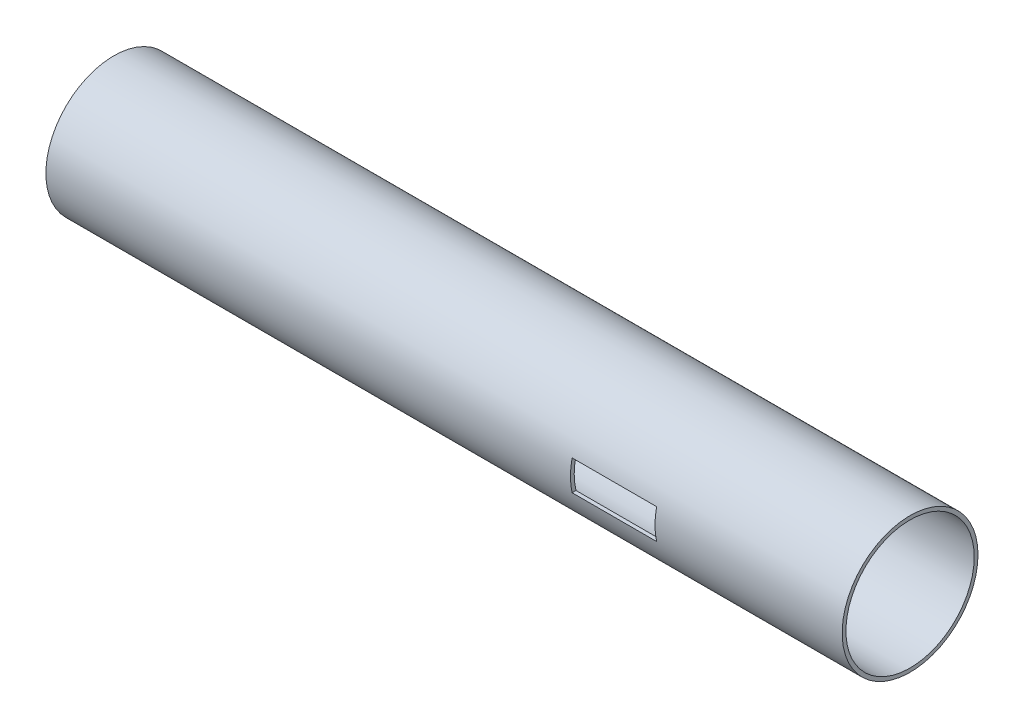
ISO-10303-21;
HEADER;
FILE_DESCRIPTION(('STEP AP214'),'2;1');
FILE_NAME('part.step','',(''),(''),'','','');
FILE_SCHEMA(('AUTOMOTIVE_DESIGN { 1 0 10303 214 1 1 1 1 }'));
ENDSEC;
DATA;
#1=APPLICATION_CONTEXT('core data for automotive mechanical design processes');
#2=APPLICATION_PROTOCOL_DEFINITION('international standard','automotive_design',2000,#1);
#3=PRODUCT_CONTEXT('',#1,'mechanical');
#4=PRODUCT('Part','Part','',(#3));
#5=PRODUCT_RELATED_PRODUCT_CATEGORY('part','',(#4));
#6=PRODUCT_DEFINITION_FORMATION('','',#4);
#7=PRODUCT_DEFINITION_CONTEXT('part definition',#1,'design');
#8=PRODUCT_DEFINITION('design','',#6,#7);
#9=PRODUCT_DEFINITION_SHAPE('','',#8);
#10=(LENGTH_UNIT() NAMED_UNIT(*) SI_UNIT(.MILLI.,.METRE.));
#11=(NAMED_UNIT(*) PLANE_ANGLE_UNIT() SI_UNIT($,.RADIAN.));
#12=(NAMED_UNIT(*) SI_UNIT($,.STERADIAN.) SOLID_ANGLE_UNIT());
#13=UNCERTAINTY_MEASURE_WITH_UNIT(LENGTH_MEASURE(1.E-05),#10,'distance_accuracy_value','');
#14=(GEOMETRIC_REPRESENTATION_CONTEXT(3) GLOBAL_UNCERTAINTY_ASSIGNED_CONTEXT((#13)) GLOBAL_UNIT_ASSIGNED_CONTEXT((#10,
#11,#12)) REPRESENTATION_CONTEXT('',''));
#15=CARTESIAN_POINT('',(0.,0.,0.));
#16=DIRECTION('',(0.,0.,1.));
#17=DIRECTION('',(1.,0.,0.));
#18=AXIS2_PLACEMENT_3D('',#15,#16,#17);
#19=CARTESIAN_POINT('',(334.9625,0.,0.));
#20=DIRECTION('',(-1.,0.,0.));
#21=DIRECTION('',(0.,0.,1.));
#22=AXIS2_PLACEMENT_3D('',#19,#20,#21);
#23=CYLINDRICAL_SURFACE('',#22,28.575);
#24=CARTESIAN_POINT('',(334.9625,0.,0.));
#25=DIRECTION('',(1.,0.,0.));
#26=DIRECTION('',(0.,0.,-1.));
#27=AXIS2_PLACEMENT_3D('',#24,#25,#26);
#28=CIRCLE('',#27,28.575);
#29=CARTESIAN_POINT('',(334.9625,0.,-28.575));
#30=VERTEX_POINT('',#29);
#31=EDGE_CURVE('E98',#30,#30,#28,.T.);
#32=ORIENTED_EDGE('',*,*,#31,.F.);
#33=EDGE_LOOP('',(#32));
#34=FACE_BOUND('',#33,.T.);
#35=CARTESIAN_POINT('',(0.,0.,0.));
#36=DIRECTION('',(1.,0.,0.));
#37=DIRECTION('',(0.,0.,-1.));
#38=AXIS2_PLACEMENT_3D('',#35,#36,#37);
#39=CIRCLE('',#38,28.575);
#40=CARTESIAN_POINT('',(0.,0.,-28.575));
#41=VERTEX_POINT('',#40);
#42=EDGE_CURVE('E95',#41,#41,#39,.T.);
#43=ORIENTED_EDGE('',*,*,#42,.T.);
#44=EDGE_LOOP('',(#43));
#45=FACE_BOUND('',#44,.T.);
#46=CARTESIAN_POINT('',(256.2225,0.,0.));
#47=DIRECTION('',(-1.,0.,0.));
#48=DIRECTION('',(0.,0.,1.));
#49=AXIS2_PLACEMENT_3D('',#46,#47,#48);
#50=CIRCLE('',#49,28.575);
#51=CARTESIAN_POINT('',(256.2225,-6.35,27.86051192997));
#52=VERTEX_POINT('',#51);
#53=CARTESIAN_POINT('',(256.2225,6.35,27.86051192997));
#54=VERTEX_POINT('',#53);
#55=EDGE_CURVE('E45',#52,#54,#50,.T.);
#56=ORIENTED_EDGE('',*,*,#55,.F.);
#57=DIRECTION('',(-1.,0.,0.));
#58=VECTOR('',#57,1.);
#59=CARTESIAN_POINT('',(334.9625,-6.34999999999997,27.86051192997));
#60=LINE('',#59,#58);
#61=CARTESIAN_POINT('',(220.6625,-6.35000000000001,27.86051192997));
#62=VERTEX_POINT('',#61);
#63=EDGE_CURVE('E73',#62,#52,#60,.F.);
#64=ORIENTED_EDGE('',*,*,#63,.F.);
#65=CARTESIAN_POINT('',(220.6625,0.,0.));
#66=DIRECTION('',(1.,0.,0.));
#67=DIRECTION('',(0.,0.,-1.));
#68=AXIS2_PLACEMENT_3D('',#65,#66,#67);
#69=CIRCLE('',#68,28.575);
#70=CARTESIAN_POINT('',(220.6625,6.35000000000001,27.86051192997));
#71=VERTEX_POINT('',#70);
#72=EDGE_CURVE('E84',#71,#62,#69,.T.);
#73=ORIENTED_EDGE('',*,*,#72,.F.);
#74=DIRECTION('',(-1.,0.,0.));
#75=VECTOR('',#74,1.);
#76=CARTESIAN_POINT('',(334.9625,6.34999999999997,27.86051192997));
#77=LINE('',#76,#75);
#78=EDGE_CURVE('E79',#54,#71,#77,.T.);
#79=ORIENTED_EDGE('',*,*,#78,.F.);
#80=EDGE_LOOP('',(#56,#64,#73,#79));
#81=FACE_BOUND('',#80,.T.);
#82=ADVANCED_FACE('F31',(#34,#45,#81),#23,.T.);
#83=CARTESIAN_POINT('',(334.9625,0.,0.));
#84=DIRECTION('',(-1.,0.,0.));
#85=DIRECTION('',(0.,0.,1.));
#86=AXIS2_PLACEMENT_3D('',#83,#84,#85);
#87=CYLINDRICAL_SURFACE('',#86,26.9875);
#88=CARTESIAN_POINT('',(0.,0.,0.));
#89=DIRECTION('',(1.,0.,0.));
#90=DIRECTION('',(0.,0.,-1.));
#91=AXIS2_PLACEMENT_3D('',#88,#89,#90);
#92=CIRCLE('',#91,26.9875);
#93=CARTESIAN_POINT('',(0.,0.,-26.9875));
#94=VERTEX_POINT('',#93);
#95=EDGE_CURVE('E85',#94,#94,#92,.T.);
#96=ORIENTED_EDGE('',*,*,#95,.F.);
#97=EDGE_LOOP('',(#96));
#98=FACE_BOUND('',#97,.T.);
#99=CARTESIAN_POINT('',(334.9625,0.,0.));
#100=DIRECTION('',(1.,0.,0.));
#101=DIRECTION('',(0.,0.,-1.));
#102=AXIS2_PLACEMENT_3D('',#99,#100,#101);
#103=CIRCLE('',#102,26.9875);
#104=CARTESIAN_POINT('',(334.9625,0.,-26.9875));
#105=VERTEX_POINT('',#104);
#106=EDGE_CURVE('E88',#105,#105,#103,.T.);
#107=ORIENTED_EDGE('',*,*,#106,.T.);
#108=EDGE_LOOP('',(#107));
#109=FACE_BOUND('',#108,.T.);
#110=CARTESIAN_POINT('',(256.2225,0.,0.));
#111=DIRECTION('',(-1.,0.,0.));
#112=DIRECTION('',(0.,0.,1.));
#113=AXIS2_PLACEMENT_3D('',#110,#111,#112);
#114=CIRCLE('',#113,26.9875);
#115=CARTESIAN_POINT('',(256.2225,-6.35,26.2298047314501));
#116=VERTEX_POINT('',#115);
#117=CARTESIAN_POINT('',(256.2225,6.35,26.2298047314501));
#118=VERTEX_POINT('',#117);
#119=EDGE_CURVE('E101',#116,#118,#114,.T.);
#120=ORIENTED_EDGE('',*,*,#119,.T.);
#121=DIRECTION('',(-1.,0.,0.));
#122=VECTOR('',#121,1.);
#123=CARTESIAN_POINT('',(334.9625,6.34999999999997,26.2298047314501));
#124=LINE('',#123,#122);
#125=CARTESIAN_POINT('',(220.6625,6.35000000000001,26.2298047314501));
#126=VERTEX_POINT('',#125);
#127=EDGE_CURVE('E11',#118,#126,#124,.T.);
#128=ORIENTED_EDGE('',*,*,#127,.T.);
#129=CARTESIAN_POINT('',(220.6625,0.,0.));
#130=DIRECTION('',(1.,0.,0.));
#131=DIRECTION('',(0.,0.,-1.));
#132=AXIS2_PLACEMENT_3D('',#129,#130,#131);
#133=CIRCLE('',#132,26.9875);
#134=CARTESIAN_POINT('',(220.6625,-6.35000000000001,26.2298047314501));
#135=VERTEX_POINT('',#134);
#136=EDGE_CURVE('E38',#126,#135,#133,.T.);
#137=ORIENTED_EDGE('',*,*,#136,.T.);
#138=DIRECTION('',(-1.,0.,0.));
#139=VECTOR('',#138,1.);
#140=CARTESIAN_POINT('',(334.9625,-6.34999999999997,26.2298047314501));
#141=LINE('',#140,#139);
#142=EDGE_CURVE('E103',#135,#116,#141,.F.);
#143=ORIENTED_EDGE('',*,*,#142,.T.);
#144=EDGE_LOOP('',(#120,#128,#137,#143));
#145=FACE_BOUND('',#144,.T.);
#146=ADVANCED_FACE('F107',(#98,#109,#145),#87,.F.);
#147=CARTESIAN_POINT('',(334.9625,0.,0.));
#148=DIRECTION('',(1.,0.,0.));
#149=DIRECTION('',(0.,0.,-1.));
#150=AXIS2_PLACEMENT_3D('',#147,#148,#149);
#151=PLANE('',#150);
#152=ORIENTED_EDGE('',*,*,#31,.T.);
#153=EDGE_LOOP('',(#152));
#154=FACE_BOUND('',#153,.T.);
#155=ORIENTED_EDGE('',*,*,#106,.F.);
#156=EDGE_LOOP('',(#155));
#157=FACE_BOUND('',#156,.T.);
#158=ADVANCED_FACE('F131',(#154,#157),#151,.T.);
#159=CARTESIAN_POINT('',(0.,0.,0.));
#160=DIRECTION('',(1.,0.,0.));
#161=DIRECTION('',(0.,0.,-1.));
#162=AXIS2_PLACEMENT_3D('',#159,#160,#161);
#163=PLANE('',#162);
#164=ORIENTED_EDGE('',*,*,#42,.F.);
#165=EDGE_LOOP('',(#164));
#166=FACE_BOUND('',#165,.T.);
#167=ORIENTED_EDGE('',*,*,#95,.T.);
#168=EDGE_LOOP('',(#167));
#169=FACE_BOUND('',#168,.T.);
#170=ADVANCED_FACE('F138',(#166,#169),#163,.F.);
#171=CARTESIAN_POINT('',(220.6625,6.35000000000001,28.575));
#172=DIRECTION('',(0.,-1.,0.));
#173=DIRECTION('',(1.,0.,0.));
#174=AXIS2_PLACEMENT_3D('',#171,#172,#173);
#175=PLANE('',#174);
#176=ORIENTED_EDGE('',*,*,#78,.T.);
#177=DIRECTION('',(0.,0.,-1.));
#178=VECTOR('',#177,1.);
#179=CARTESIAN_POINT('',(220.6625,6.35000000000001,28.575));
#180=LINE('',#179,#178);
#181=EDGE_CURVE('E74',#71,#126,#180,.T.);
#182=ORIENTED_EDGE('',*,*,#181,.T.);
#183=ORIENTED_EDGE('',*,*,#127,.F.);
#184=DIRECTION('',(0.,0.,-1.));
#185=VECTOR('',#184,1.);
#186=CARTESIAN_POINT('',(256.2225,6.35,28.575));
#187=LINE('',#186,#185);
#188=EDGE_CURVE('E52',#54,#118,#187,.T.);
#189=ORIENTED_EDGE('',*,*,#188,.F.);
#190=EDGE_LOOP('',(#176,#182,#183,#189));
#191=FACE_BOUND('',#190,.T.);
#192=ADVANCED_FACE('F77',(#191),#175,.T.);
#193=CARTESIAN_POINT('',(220.6625,-6.35000000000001,28.575));
#194=DIRECTION('',(1.,0.,0.));
#195=DIRECTION('',(0.,0.,-1.));
#196=AXIS2_PLACEMENT_3D('',#193,#194,#195);
#197=PLANE('',#196);
#198=ORIENTED_EDGE('',*,*,#72,.T.);
#199=DIRECTION('',(0.,0.,-1.));
#200=VECTOR('',#199,1.);
#201=CARTESIAN_POINT('',(220.6625,-6.35000000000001,28.575));
#202=LINE('',#201,#200);
#203=EDGE_CURVE('E112',#62,#135,#202,.T.);
#204=ORIENTED_EDGE('',*,*,#203,.T.);
#205=ORIENTED_EDGE('',*,*,#136,.F.);
#206=ORIENTED_EDGE('',*,*,#181,.F.);
#207=EDGE_LOOP('',(#198,#204,#205,#206));
#208=FACE_BOUND('',#207,.T.);
#209=ADVANCED_FACE('F110',(#208),#197,.T.);
#210=CARTESIAN_POINT('',(220.6625,-6.35000000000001,28.575));
#211=DIRECTION('',(0.,1.,0.));
#212=DIRECTION('',(-1.,0.,0.));
#213=AXIS2_PLACEMENT_3D('',#210,#211,#212);
#214=PLANE('',#213);
#215=ORIENTED_EDGE('',*,*,#63,.T.);
#216=DIRECTION('',(0.,0.,-1.));
#217=VECTOR('',#216,1.);
#218=CARTESIAN_POINT('',(256.2225,-6.35,28.575));
#219=LINE('',#218,#217);
#220=EDGE_CURVE('E71',#52,#116,#219,.T.);
#221=ORIENTED_EDGE('',*,*,#220,.T.);
#222=ORIENTED_EDGE('',*,*,#142,.F.);
#223=ORIENTED_EDGE('',*,*,#203,.F.);
#224=EDGE_LOOP('',(#215,#221,#222,#223));
#225=FACE_BOUND('',#224,.T.);
#226=ADVANCED_FACE('F117',(#225),#214,.T.);
#227=CARTESIAN_POINT('',(256.2225,6.35,28.575));
#228=DIRECTION('',(-1.,0.,0.));
#229=DIRECTION('',(0.,0.,1.));
#230=AXIS2_PLACEMENT_3D('',#227,#228,#229);
#231=PLANE('',#230);
#232=ORIENTED_EDGE('',*,*,#55,.T.);
#233=ORIENTED_EDGE('',*,*,#188,.T.);
#234=ORIENTED_EDGE('',*,*,#119,.F.);
#235=ORIENTED_EDGE('',*,*,#220,.F.);
#236=EDGE_LOOP('',(#232,#233,#234,#235));
#237=FACE_BOUND('',#236,.T.);
#238=ADVANCED_FACE('F69',(#237),#231,.T.);
#239=CLOSED_SHELL('',(#82,#146,#158,#170,#192,#209,#226,#238));
#240=MANIFOLD_SOLID_BREP('B2',#239);
#241=ADVANCED_BREP_SHAPE_REPRESENTATION('',(#18,#240),#14);
#242=SHAPE_DEFINITION_REPRESENTATION(#9,#241);
ENDSEC;
END-ISO-10303-21;
